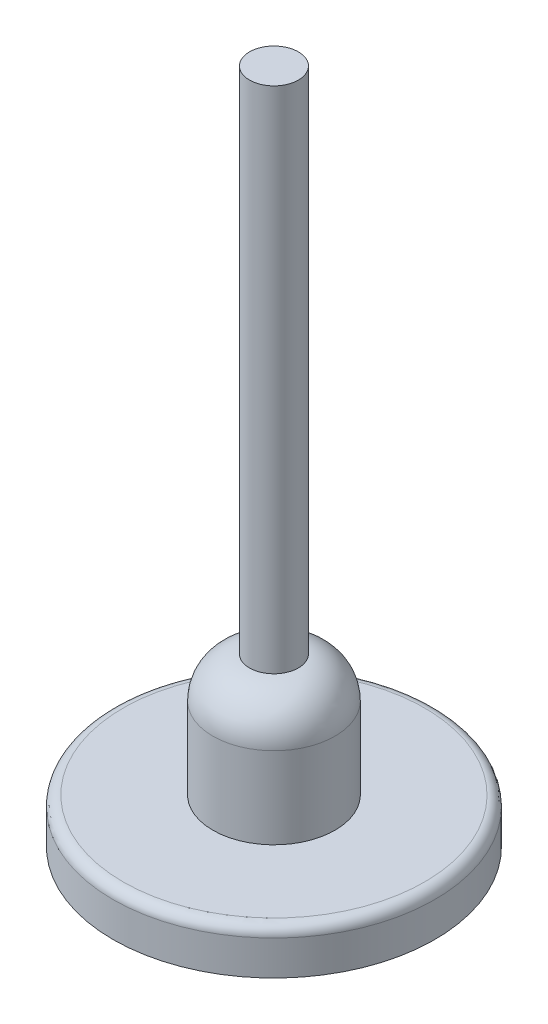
ISO-10303-21;
HEADER;
FILE_DESCRIPTION(('STEP AP214'),'2;1');
FILE_NAME('part.step','',(''),(''),'','','');
FILE_SCHEMA(('AUTOMOTIVE_DESIGN { 1 0 10303 214 1 1 1 1 }'));
ENDSEC;
DATA;
#1=APPLICATION_CONTEXT('core data for automotive mechanical design processes');
#2=APPLICATION_PROTOCOL_DEFINITION('international standard','automotive_design',2000,#1);
#3=PRODUCT_CONTEXT('',#1,'mechanical');
#4=PRODUCT('Part','Part','',(#3));
#5=PRODUCT_RELATED_PRODUCT_CATEGORY('part','',(#4));
#6=PRODUCT_DEFINITION_FORMATION('','',#4);
#7=PRODUCT_DEFINITION_CONTEXT('part definition',#1,'design');
#8=PRODUCT_DEFINITION('design','',#6,#7);
#9=PRODUCT_DEFINITION_SHAPE('','',#8);
#10=(LENGTH_UNIT() NAMED_UNIT(*) SI_UNIT(.MILLI.,.METRE.));
#11=(NAMED_UNIT(*) PLANE_ANGLE_UNIT() SI_UNIT($,.RADIAN.));
#12=(NAMED_UNIT(*) SI_UNIT($,.STERADIAN.) SOLID_ANGLE_UNIT());
#13=UNCERTAINTY_MEASURE_WITH_UNIT(LENGTH_MEASURE(1.E-05),#10,'distance_accuracy_value','');
#14=(GEOMETRIC_REPRESENTATION_CONTEXT(3) GLOBAL_UNCERTAINTY_ASSIGNED_CONTEXT((#13)) GLOBAL_UNIT_ASSIGNED_CONTEXT((#10,
#11,#12)) REPRESENTATION_CONTEXT('',''));
#15=CARTESIAN_POINT('',(0.,0.,0.));
#16=DIRECTION('',(0.,0.,1.));
#17=DIRECTION('',(1.,0.,0.));
#18=AXIS2_PLACEMENT_3D('',#15,#16,#17);
#19=CARTESIAN_POINT('',(0.,11.,0.));
#20=DIRECTION('',(0.,1.,0.));
#21=DIRECTION('',(0.,0.,1.));
#22=AXIS2_PLACEMENT_3D('',#19,#20,#21);
#23=PLANE('',#22);
#24=CARTESIAN_POINT('',(0.,11.,0.));
#25=DIRECTION('',(0.,1.,0.));
#26=DIRECTION('',(0.,0.,1.));
#27=AXIS2_PLACEMENT_3D('',#24,#25,#26);
#28=CIRCLE('',#27,37.);
#29=CARTESIAN_POINT('',(0.,11.,37.));
#30=VERTEX_POINT('',#29);
#31=EDGE_CURVE('E45',#30,#30,#28,.T.);
#32=ORIENTED_EDGE('',*,*,#31,.T.);
#33=EDGE_LOOP('',(#32));
#34=FACE_BOUND('',#33,.T.);
#35=CARTESIAN_POINT('',(0.,11.,0.));
#36=DIRECTION('',(0.,1.,0.));
#37=DIRECTION('',(0.,0.,1.));
#38=AXIS2_PLACEMENT_3D('',#35,#36,#37);
#39=CIRCLE('',#38,15.);
#40=CARTESIAN_POINT('',(0.,11.,15.));
#41=VERTEX_POINT('',#40);
#42=EDGE_CURVE('E53',#41,#41,#39,.T.);
#43=ORIENTED_EDGE('',*,*,#42,.F.);
#44=EDGE_LOOP('',(#43));
#45=FACE_BOUND('',#44,.T.);
#46=ADVANCED_FACE('F30',(#34,#45),#23,.T.);
#47=CARTESIAN_POINT('',(0.,11.,0.));
#48=DIRECTION('',(0.,-1.,0.));
#49=DIRECTION('',(0.,0.,-1.));
#50=AXIS2_PLACEMENT_3D('',#47,#48,#49);
#51=CYLINDRICAL_SURFACE('',#50,39.5);
#52=CARTESIAN_POINT('',(0.,8.5,0.));
#53=DIRECTION('',(0.,1.,0.));
#54=DIRECTION('',(0.,0.,1.));
#55=AXIS2_PLACEMENT_3D('',#52,#53,#54);
#56=CIRCLE('',#55,39.5);
#57=CARTESIAN_POINT('',(0.,8.5,39.5));
#58=VERTEX_POINT('',#57);
#59=EDGE_CURVE('E41',#58,#58,#56,.F.);
#60=ORIENTED_EDGE('',*,*,#59,.T.);
#61=EDGE_LOOP('',(#60));
#62=FACE_BOUND('',#61,.T.);
#63=CARTESIAN_POINT('',(0.,0.,0.));
#64=DIRECTION('',(0.,1.,0.));
#65=DIRECTION('',(0.,0.,1.));
#66=AXIS2_PLACEMENT_3D('',#63,#64,#65);
#67=CIRCLE('',#66,39.5);
#68=CARTESIAN_POINT('',(0.,0.,39.5));
#69=VERTEX_POINT('',#68);
#70=EDGE_CURVE('E50',#69,#69,#67,.T.);
#71=ORIENTED_EDGE('',*,*,#70,.T.);
#72=EDGE_LOOP('',(#71));
#73=FACE_BOUND('',#72,.T.);
#74=ADVANCED_FACE('F79',(#62,#73),#51,.T.);
#75=CARTESIAN_POINT('',(0.,0.,0.));
#76=DIRECTION('',(0.,1.,0.));
#77=DIRECTION('',(0.,0.,1.));
#78=AXIS2_PLACEMENT_3D('',#75,#76,#77);
#79=PLANE('',#78);
#80=ORIENTED_EDGE('',*,*,#70,.F.);
#81=EDGE_LOOP('',(#80));
#82=FACE_BOUND('',#81,.T.);
#83=ADVANCED_FACE('F85',(#82),#79,.F.);
#84=CARTESIAN_POINT('',(0.,8.5,0.));
#85=DIRECTION('',(0.,1.,0.));
#86=DIRECTION('',(0.,0.,1.));
#87=AXIS2_PLACEMENT_3D('',#84,#85,#86);
#88=TOROIDAL_SURFACE('',#87,37.,2.5);
#89=ORIENTED_EDGE('',*,*,#59,.F.);
#90=EDGE_LOOP('',(#89));
#91=FACE_BOUND('',#90,.T.);
#92=ORIENTED_EDGE('',*,*,#31,.F.);
#93=EDGE_LOOP('',(#92));
#94=FACE_BOUND('',#93,.T.);
#95=ADVANCED_FACE('F93',(#91,#94),#88,.T.);
#96=CARTESIAN_POINT('',(0.,41.,0.));
#97=DIRECTION('',(0.,-1.,0.));
#98=DIRECTION('',(0.,0.,-1.));
#99=AXIS2_PLACEMENT_3D('',#96,#97,#98);
#100=CYLINDRICAL_SURFACE('',#99,15.);
#101=CARTESIAN_POINT('',(0.,31.,0.));
#102=DIRECTION('',(0.,1.,0.));
#103=DIRECTION('',(0.,0.,1.));
#104=AXIS2_PLACEMENT_3D('',#101,#102,#103);
#105=CIRCLE('',#104,15.);
#106=CARTESIAN_POINT('',(0.,31.,15.));
#107=VERTEX_POINT('',#106);
#108=EDGE_CURVE('E10',#107,#107,#105,.F.);
#109=ORIENTED_EDGE('',*,*,#108,.T.);
#110=EDGE_LOOP('',(#109));
#111=FACE_BOUND('',#110,.T.);
#112=ORIENTED_EDGE('',*,*,#42,.T.);
#113=EDGE_LOOP('',(#112));
#114=FACE_BOUND('',#113,.T.);
#115=ADVANCED_FACE('F91',(#111,#114),#100,.T.);
#116=CARTESIAN_POINT('',(0.,31.,0.));
#117=DIRECTION('',(0.,1.,0.));
#118=DIRECTION('',(0.,0.,1.));
#119=AXIS2_PLACEMENT_3D('',#116,#117,#118);
#120=DEGENERATE_TOROIDAL_SURFACE('',#119,5.,10.,.T.);
#121=ORIENTED_EDGE('',*,*,#108,.F.);
#122=EDGE_LOOP('',(#121));
#123=FACE_BOUND('',#122,.T.);
#124=CARTESIAN_POINT('',(0.,41.,0.));
#125=DIRECTION('',(0.,1.,0.));
#126=DIRECTION('',(0.,0.,1.));
#127=AXIS2_PLACEMENT_3D('',#124,#125,#126);
#128=CIRCLE('',#127,5.);
#129=CARTESIAN_POINT('',(0.,41.,5.));
#130=VERTEX_POINT('',#129);
#131=EDGE_CURVE('E37',#130,#130,#128,.T.);
#132=ORIENTED_EDGE('',*,*,#131,.F.);
#133=EDGE_LOOP('',(#132));
#134=FACE_BOUND('',#133,.T.);
#135=ADVANCED_FACE('F32',(#123,#134),#120,.T.);
#136=CARTESIAN_POINT('',(0.,166.,0.));
#137=DIRECTION('',(0.,-1.,0.));
#138=DIRECTION('',(0.,0.,-1.));
#139=AXIS2_PLACEMENT_3D('',#136,#137,#138);
#140=CYLINDRICAL_SURFACE('',#139,6.);
#141=CARTESIAN_POINT('',(0.,166.,0.));
#142=DIRECTION('',(0.,1.,0.));
#143=DIRECTION('',(0.,0.,1.));
#144=AXIS2_PLACEMENT_3D('',#141,#142,#143);
#145=CIRCLE('',#144,6.);
#146=CARTESIAN_POINT('',(0.,166.,6.));
#147=VERTEX_POINT('',#146);
#148=EDGE_CURVE('E56',#147,#147,#145,.T.);
#149=ORIENTED_EDGE('',*,*,#148,.F.);
#150=EDGE_LOOP('',(#149));
#151=FACE_BOUND('',#150,.T.);
#152=CARTESIAN_POINT('',(0.,41.,0.));
#153=DIRECTION('',(0.,1.,0.));
#154=DIRECTION('',(0.,0.,1.));
#155=AXIS2_PLACEMENT_3D('',#152,#153,#154);
#156=CIRCLE('',#155,6.);
#157=CARTESIAN_POINT('',(0.,41.,6.));
#158=VERTEX_POINT('',#157);
#159=EDGE_CURVE('E57',#158,#158,#156,.T.);
#160=ORIENTED_EDGE('',*,*,#159,.T.);
#161=EDGE_LOOP('',(#160));
#162=FACE_BOUND('',#161,.T.);
#163=ADVANCED_FACE('F65',(#151,#162),#140,.T.);
#164=CARTESIAN_POINT('',(0.,166.,0.));
#165=DIRECTION('',(0.,1.,0.));
#166=DIRECTION('',(0.,0.,1.));
#167=AXIS2_PLACEMENT_3D('',#164,#165,#166);
#168=PLANE('',#167);
#169=ORIENTED_EDGE('',*,*,#148,.T.);
#170=EDGE_LOOP('',(#169));
#171=FACE_BOUND('',#170,.T.);
#172=ADVANCED_FACE('F63',(#171),#168,.T.);
#173=CARTESIAN_POINT('',(0.,41.,0.));
#174=DIRECTION('',(0.,1.,0.));
#175=DIRECTION('',(0.,0.,1.));
#176=AXIS2_PLACEMENT_3D('',#173,#174,#175);
#177=PLANE('',#176);
#178=ORIENTED_EDGE('',*,*,#131,.T.);
#179=EDGE_LOOP('',(#178));
#180=FACE_BOUND('',#179,.T.);
#181=ORIENTED_EDGE('',*,*,#159,.F.);
#182=EDGE_LOOP('',(#181));
#183=FACE_BOUND('',#182,.T.);
#184=ADVANCED_FACE('F71',(#180,#183),#177,.F.);
#185=CLOSED_SHELL('',(#46,#74,#83,#95,#115,#135,#163,#172,#184));
#186=MANIFOLD_SOLID_BREP('B2',#185);
#187=ADVANCED_BREP_SHAPE_REPRESENTATION('',(#18,#186),#14);
#188=SHAPE_DEFINITION_REPRESENTATION(#9,#187);
ENDSEC;
END-ISO-10303-21;
